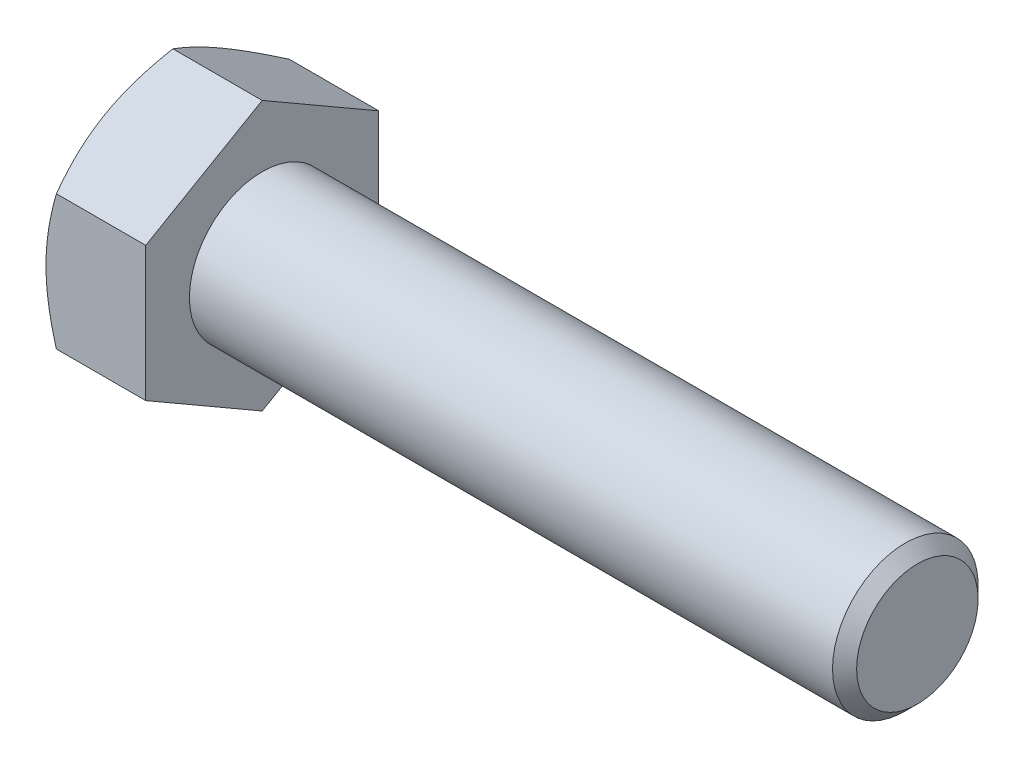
from build123d import *

# Parameters (mm, degrees)
BASEHEAD_DEPTH = 6.85


with BuildPart() as part:
    # Sketch1 → BaseHead (new body)
    with BuildSketch(Plane(origin=(0, 0, 0), x_dir=(0, 0, -1), z_dir=(1, 0, 0))):
        Polygon((8, 4.618802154), (8, -4.618802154), (0, -9.237604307), (-8, -4.618802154), (-8, 4.618802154), (0, 9.237604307), align=None)
    extrude(amount=BASEHEAD_DEPTH)

    # BodySke → BaseBody (revolve)
    with BuildSketch(Plane.XY, mode=Mode.PRIVATE) as basebody_sk:
        Polygon((0, 0), (51.85, 0), (51.85, 4.172), (51.022, 5), (0, 5), align=None)
    revolve(basebody_sk.sketch.rotate(Axis((0, 0, 0), (1, 0, 0)), 90), axis=Axis((0, 0, 0), (1, 0, 0)))

    # Sketch3 → HeadChamfer (revolve, cut)
    with BuildSketch(Plane.XY):
        Polygon((0, 8), (3.601282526, 14.237604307), (3.601282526, 19.237604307), (-10, 19.237604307), (-10, 8), align=None)
    revolve(axis=Axis((0, 0, 0), (1, 0, 0)), mode=Mode.SUBTRACT)


solid = part.part
